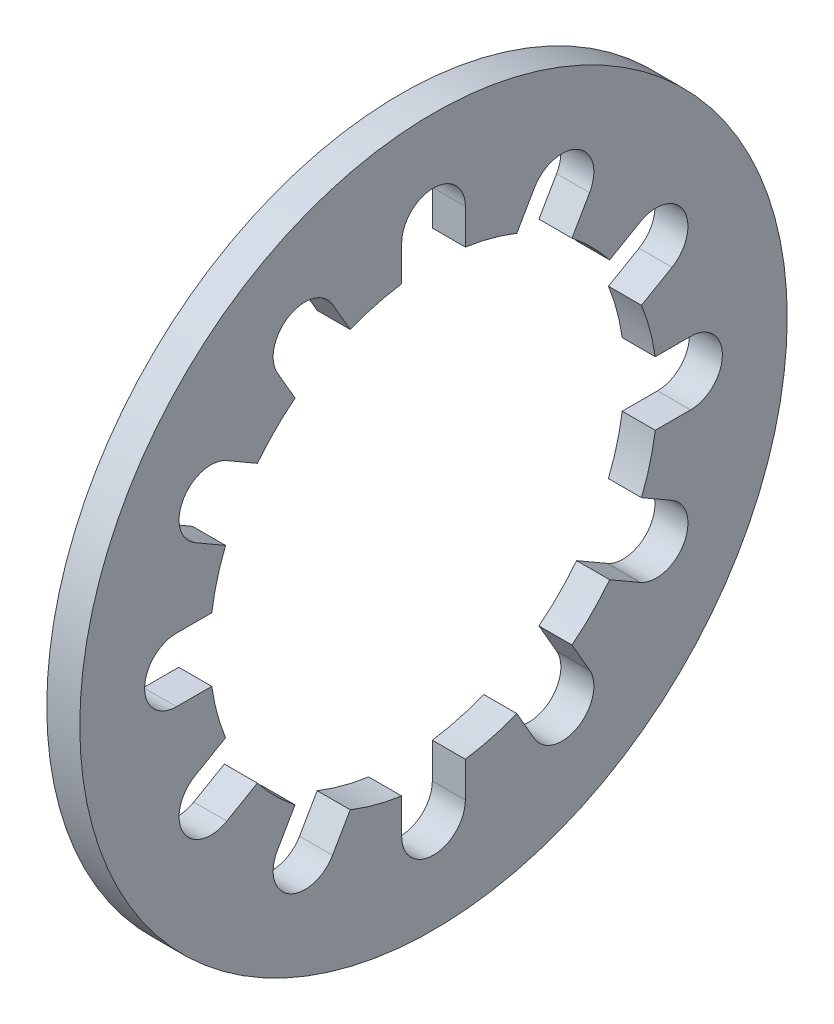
from build123d import *

# Parameters (mm, degrees)
SKETCH1_R          = 15
SKETCH1_R_2        = 9.5
BASE_EXTRUDE_DEPTH = 1.4
TYPEJSLOT_DEPTH    = 22.259350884
TYPEJPATTERN_COUNT = 12


with BuildPart() as part:
    # Sketch1 → Base-Extrude (new body)
    with BuildSketch(Plane(origin=(0, 0, 0), x_dir=(0, 0, -1), z_dir=(1, 0, 0))):
        Circle(SKETCH1_R)
        Circle(SKETCH1_R_2, mode=Mode.SUBTRACT)
    extrude(amount=-BASE_EXTRUDE_DEPTH)

    # Sketch2 → TypeJSlot (cut, through all)
    with BuildSketch(Plane(origin=(0, 0, 0), x_dir=(0, 0, -1), z_dir=(1, 0, 0))):
        with BuildLine():
            Line((1.35, 0), (1.35, 10.9))
            ThreePointArc((1.35, 10.9), (0, 12.25), (-1.35, 10.9))
            Line((-1.35, 10.9), (-1.35, 0))
            Line((-1.35, 0), (1.35, 0))
        make_face()
    typejslot = extrude(amount=-TYPEJSLOT_DEPTH, mode=Mode.SUBTRACT)

    # TypeJPattern: TypeJSlot ×12 about axis
    typejpattern_axis = Axis((0, 0, 0), (1, 0, 0))
    for i in range(1, TYPEJPATTERN_COUNT):
        add(typejslot.rotate(typejpattern_axis, i * 360 / TYPEJPATTERN_COUNT), mode=Mode.SUBTRACT)


solid = part.part
